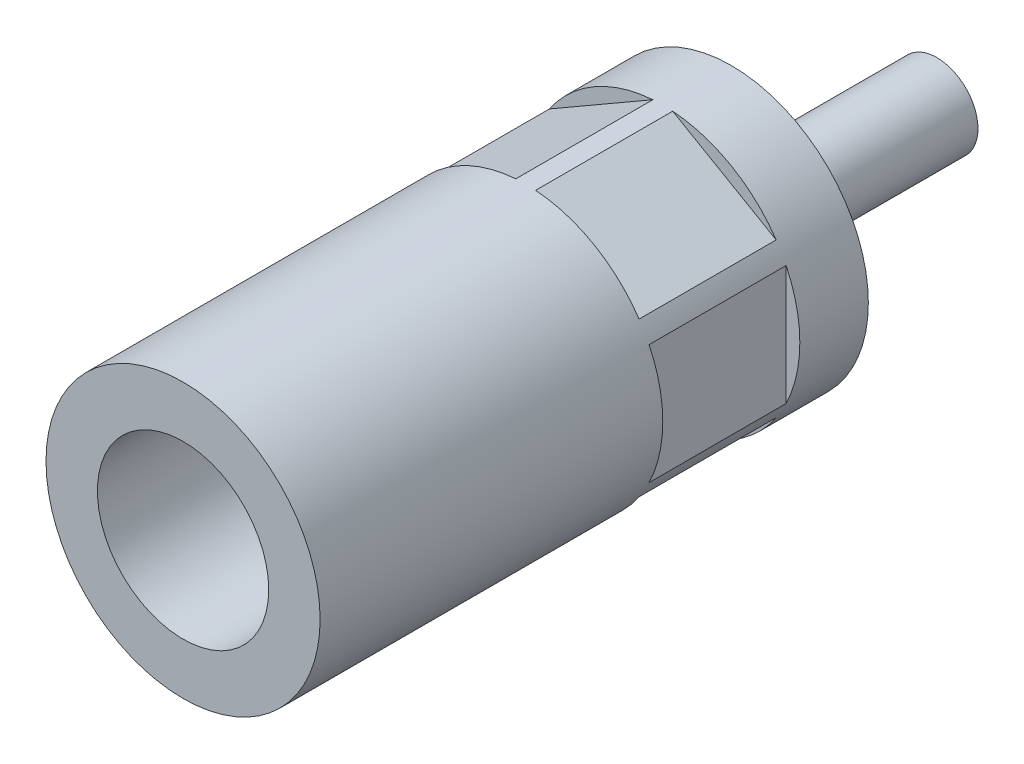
ISO-10303-21;
HEADER;
FILE_DESCRIPTION(('STEP AP214'),'2;1');
FILE_NAME('part.step','',(''),(''),'','','');
FILE_SCHEMA(('AUTOMOTIVE_DESIGN { 1 0 10303 214 1 1 1 1 }'));
ENDSEC;
DATA;
#1=APPLICATION_CONTEXT('core data for automotive mechanical design processes');
#2=APPLICATION_PROTOCOL_DEFINITION('international standard','automotive_design',2000,#1);
#3=PRODUCT_CONTEXT('',#1,'mechanical');
#4=PRODUCT('Part','Part','',(#3));
#5=PRODUCT_RELATED_PRODUCT_CATEGORY('part','',(#4));
#6=PRODUCT_DEFINITION_FORMATION('','',#4);
#7=PRODUCT_DEFINITION_CONTEXT('part definition',#1,'design');
#8=PRODUCT_DEFINITION('design','',#6,#7);
#9=PRODUCT_DEFINITION_SHAPE('','',#8);
#10=(LENGTH_UNIT() NAMED_UNIT(*) SI_UNIT(.MILLI.,.METRE.));
#11=(NAMED_UNIT(*) PLANE_ANGLE_UNIT() SI_UNIT($,.RADIAN.));
#12=(NAMED_UNIT(*) SI_UNIT($,.STERADIAN.) SOLID_ANGLE_UNIT());
#13=UNCERTAINTY_MEASURE_WITH_UNIT(LENGTH_MEASURE(1.E-05),#10,'distance_accuracy_value','');
#14=(GEOMETRIC_REPRESENTATION_CONTEXT(3) GLOBAL_UNCERTAINTY_ASSIGNED_CONTEXT((#13)) GLOBAL_UNIT_ASSIGNED_CONTEXT((#10,
#11,#12)) REPRESENTATION_CONTEXT('',''));
#15=CARTESIAN_POINT('',(0.,0.,0.));
#16=DIRECTION('',(0.,0.,1.));
#17=DIRECTION('',(1.,0.,0.));
#18=AXIS2_PLACEMENT_3D('',#15,#16,#17);
#19=CARTESIAN_POINT('',(0.,0.,80.));
#20=DIRECTION('',(0.,0.,1.));
#21=DIRECTION('',(1.,0.,0.));
#22=AXIS2_PLACEMENT_3D('',#19,#20,#21);
#23=CYLINDRICAL_SURFACE('',#22,20.);
#24=CARTESIAN_POINT('',(0.,0.,10.));
#25=DIRECTION('',(0.,0.,1.));
#26=DIRECTION('',(1.,0.,0.));
#27=AXIS2_PLACEMENT_3D('',#24,#25,#26);
#28=CIRCLE('',#27,20.);
#29=CARTESIAN_POINT('',(-16.5498344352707,-11.2295583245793,10.));
#30=VERTEX_POINT('',#29);
#31=CARTESIAN_POINT('',(-1.45016556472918,-19.9473562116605,10.));
#32=VERTEX_POINT('',#31);
#33=EDGE_CURVE('E153',#30,#32,#28,.T.);
#34=ORIENTED_EDGE('',*,*,#33,.F.);
#35=DIRECTION('',(0.,0.,1.));
#36=VECTOR('',#35,1.);
#37=CARTESIAN_POINT('',(-16.5498344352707,-11.2295583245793,80.));
#38=LINE('',#37,#36);
#39=CARTESIAN_POINT('',(-16.5498344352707,-11.2295583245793,30.));
#40=VERTEX_POINT('',#39);
#41=EDGE_CURVE('E9',#30,#40,#38,.T.);
#42=ORIENTED_EDGE('',*,*,#41,.T.);
#43=CARTESIAN_POINT('',(0.,0.,30.));
#44=DIRECTION('',(0.,0.,1.));
#45=DIRECTION('',(1.,0.,0.));
#46=AXIS2_PLACEMENT_3D('',#43,#44,#45);
#47=CIRCLE('',#46,20.);
#48=CARTESIAN_POINT('',(-1.45016556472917,-19.9473562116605,30.));
#49=VERTEX_POINT('',#48);
#50=EDGE_CURVE('E22',#40,#49,#47,.T.);
#51=ORIENTED_EDGE('',*,*,#50,.T.);
#52=DIRECTION('',(0.,0.,1.));
#53=VECTOR('',#52,1.);
#54=CARTESIAN_POINT('',(-1.45016556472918,-19.9473562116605,80.));
#55=LINE('',#54,#53);
#56=EDGE_CURVE('E150',#49,#32,#55,.F.);
#57=ORIENTED_EDGE('',*,*,#56,.T.);
#58=EDGE_LOOP('',(#34,#42,#51,#57));
#59=FACE_BOUND('',#58,.T.);
#60=DIRECTION('',(0.,0.,1.));
#61=VECTOR('',#60,1.);
#62=CARTESIAN_POINT('',(18.,8.71779788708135,80.));
#63=LINE('',#62,#61);
#64=CARTESIAN_POINT('',(18.,8.71779788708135,10.));
#65=VERTEX_POINT('',#64);
#66=CARTESIAN_POINT('',(18.,8.71779788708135,30.));
#67=VERTEX_POINT('',#66);
#68=EDGE_CURVE('E143',#65,#67,#63,.T.);
#69=ORIENTED_EDGE('',*,*,#68,.F.);
#70=CARTESIAN_POINT('',(18.,-8.71779788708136,10.));
#71=VERTEX_POINT('',#70);
#72=EDGE_CURVE('E142',#71,#65,#28,.T.);
#73=ORIENTED_EDGE('',*,*,#72,.F.);
#74=DIRECTION('',(0.,0.,1.));
#75=VECTOR('',#74,1.);
#76=CARTESIAN_POINT('',(18.,-8.71779788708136,80.));
#77=LINE('',#76,#75);
#78=CARTESIAN_POINT('',(18.,-8.71779788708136,30.));
#79=VERTEX_POINT('',#78);
#80=EDGE_CURVE('E139',#79,#71,#77,.F.);
#81=ORIENTED_EDGE('',*,*,#80,.F.);
#82=EDGE_CURVE('E146',#79,#67,#47,.T.);
#83=ORIENTED_EDGE('',*,*,#82,.T.);
#84=EDGE_LOOP('',(#69,#73,#81,#83));
#85=FACE_BOUND('',#84,.T.);
#86=CARTESIAN_POINT('',(16.5498344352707,11.2295583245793,10.));
#87=VERTEX_POINT('',#86);
#88=CARTESIAN_POINT('',(1.45016556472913,19.9473562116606,10.));
#89=VERTEX_POINT('',#88);
#90=EDGE_CURVE('E135',#87,#89,#28,.T.);
#91=ORIENTED_EDGE('',*,*,#90,.F.);
#92=DIRECTION('',(0.,0.,1.));
#93=VECTOR('',#92,1.);
#94=CARTESIAN_POINT('',(16.5498344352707,11.2295583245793,80.));
#95=LINE('',#94,#93);
#96=CARTESIAN_POINT('',(16.5498344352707,11.2295583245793,30.));
#97=VERTEX_POINT('',#96);
#98=EDGE_CURVE('E136',#87,#97,#95,.T.);
#99=ORIENTED_EDGE('',*,*,#98,.T.);
#100=CARTESIAN_POINT('',(1.45016556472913,19.9473562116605,30.));
#101=VERTEX_POINT('',#100);
#102=EDGE_CURVE('E140',#97,#101,#47,.T.);
#103=ORIENTED_EDGE('',*,*,#102,.T.);
#104=DIRECTION('',(0.,0.,1.));
#105=VECTOR('',#104,1.);
#106=CARTESIAN_POINT('',(1.45016556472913,19.9473562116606,80.));
#107=LINE('',#106,#105);
#108=EDGE_CURVE('E132',#101,#89,#107,.F.);
#109=ORIENTED_EDGE('',*,*,#108,.T.);
#110=EDGE_LOOP('',(#91,#99,#103,#109));
#111=FACE_BOUND('',#110,.T.);
#112=CARTESIAN_POINT('',(0.,0.,0.));
#113=DIRECTION('',(0.,0.,1.));
#114=DIRECTION('',(1.,0.,0.));
#115=AXIS2_PLACEMENT_3D('',#112,#113,#114);
#116=CIRCLE('',#115,20.);
#117=CARTESIAN_POINT('',(20.,0.,0.));
#118=VERTEX_POINT('',#117);
#119=EDGE_CURVE('E202',#118,#118,#116,.T.);
#120=ORIENTED_EDGE('',*,*,#119,.T.);
#121=EDGE_LOOP('',(#120));
#122=FACE_BOUND('',#121,.T.);
#123=CARTESIAN_POINT('',(0.,0.,80.));
#124=DIRECTION('',(0.,0.,1.));
#125=DIRECTION('',(1.,0.,0.));
#126=AXIS2_PLACEMENT_3D('',#123,#124,#125);
#127=CIRCLE('',#126,20.);
#128=CARTESIAN_POINT('',(20.,0.,80.));
#129=VERTEX_POINT('',#128);
#130=EDGE_CURVE('E205',#129,#129,#127,.T.);
#131=ORIENTED_EDGE('',*,*,#130,.F.);
#132=EDGE_LOOP('',(#131));
#133=FACE_BOUND('',#132,.T.);
#134=CARTESIAN_POINT('',(-18.,8.71779788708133,10.));
#135=VERTEX_POINT('',#134);
#136=CARTESIAN_POINT('',(-18.,-8.71779788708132,10.));
#137=VERTEX_POINT('',#136);
#138=EDGE_CURVE('E111',#135,#137,#28,.T.);
#139=ORIENTED_EDGE('',*,*,#138,.F.);
#140=DIRECTION('',(0.,0.,1.));
#141=VECTOR('',#140,1.);
#142=CARTESIAN_POINT('',(-18.,8.71779788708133,80.));
#143=LINE('',#142,#141);
#144=CARTESIAN_POINT('',(-18.,8.71779788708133,30.));
#145=VERTEX_POINT('',#144);
#146=EDGE_CURVE('E110',#135,#145,#143,.T.);
#147=ORIENTED_EDGE('',*,*,#146,.T.);
#148=CARTESIAN_POINT('',(-18.,-8.71779788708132,30.));
#149=VERTEX_POINT('',#148);
#150=EDGE_CURVE('E103',#145,#149,#47,.T.);
#151=ORIENTED_EDGE('',*,*,#150,.T.);
#152=DIRECTION('',(0.,0.,1.));
#153=VECTOR('',#152,1.);
#154=CARTESIAN_POINT('',(-18.,-8.71779788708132,80.));
#155=LINE('',#154,#153);
#156=EDGE_CURVE('E117',#149,#137,#155,.F.);
#157=ORIENTED_EDGE('',*,*,#156,.T.);
#158=EDGE_LOOP('',(#139,#147,#151,#157));
#159=FACE_BOUND('',#158,.T.);
#160=DIRECTION('',(0.,0.,1.));
#161=VECTOR('',#160,1.);
#162=CARTESIAN_POINT('',(-16.5498344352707,11.2295583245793,80.));
#163=LINE('',#162,#161);
#164=CARTESIAN_POINT('',(-16.5498344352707,11.2295583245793,10.));
#165=VERTEX_POINT('',#164);
#166=CARTESIAN_POINT('',(-16.5498344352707,11.2295583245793,30.));
#167=VERTEX_POINT('',#166);
#168=EDGE_CURVE('E130',#165,#167,#163,.T.);
#169=ORIENTED_EDGE('',*,*,#168,.F.);
#170=CARTESIAN_POINT('',(-1.45016556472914,19.9473562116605,10.));
#171=VERTEX_POINT('',#170);
#172=EDGE_CURVE('E126',#171,#165,#28,.T.);
#173=ORIENTED_EDGE('',*,*,#172,.F.);
#174=DIRECTION('',(0.,0.,1.));
#175=VECTOR('',#174,1.);
#176=CARTESIAN_POINT('',(-1.45016556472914,19.9473562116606,80.));
#177=LINE('',#176,#175);
#178=CARTESIAN_POINT('',(-1.45016556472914,19.9473562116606,30.));
#179=VERTEX_POINT('',#178);
#180=EDGE_CURVE('E124',#179,#171,#177,.F.);
#181=ORIENTED_EDGE('',*,*,#180,.F.);
#182=EDGE_CURVE('E113',#179,#167,#47,.T.);
#183=ORIENTED_EDGE('',*,*,#182,.T.);
#184=EDGE_LOOP('',(#169,#173,#181,#183));
#185=FACE_BOUND('',#184,.T.);
#186=DIRECTION('',(0.,0.,1.));
#187=VECTOR('',#186,1.);
#188=CARTESIAN_POINT('',(16.5498344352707,-11.2295583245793,80.));
#189=LINE('',#188,#187);
#190=CARTESIAN_POINT('',(16.5498344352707,-11.2295583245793,10.));
#191=VERTEX_POINT('',#190);
#192=CARTESIAN_POINT('',(16.5498344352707,-11.2295583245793,30.));
#193=VERTEX_POINT('',#192);
#194=EDGE_CURVE('E149',#191,#193,#189,.T.);
#195=ORIENTED_EDGE('',*,*,#194,.F.);
#196=CARTESIAN_POINT('',(1.45016556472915,-19.9473562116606,10.));
#197=VERTEX_POINT('',#196);
#198=EDGE_CURVE('E148',#197,#191,#28,.T.);
#199=ORIENTED_EDGE('',*,*,#198,.F.);
#200=DIRECTION('',(0.,0.,1.));
#201=VECTOR('',#200,1.);
#202=CARTESIAN_POINT('',(1.45016556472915,-19.9473562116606,80.));
#203=LINE('',#202,#201);
#204=CARTESIAN_POINT('',(1.45016556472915,-19.9473562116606,30.));
#205=VERTEX_POINT('',#204);
#206=EDGE_CURVE('E145',#205,#197,#203,.F.);
#207=ORIENTED_EDGE('',*,*,#206,.F.);
#208=EDGE_CURVE('E151',#205,#193,#47,.T.);
#209=ORIENTED_EDGE('',*,*,#208,.T.);
#210=EDGE_LOOP('',(#195,#199,#207,#209));
#211=FACE_BOUND('',#210,.T.);
#212=ADVANCED_FACE('F14',(#59,#85,#111,#122,#133,#159,#185,#211),#23,.T.);
#213=CARTESIAN_POINT('',(0.,0.,-30.));
#214=DIRECTION('',(0.,0.,1.));
#215=DIRECTION('',(1.,0.,0.));
#216=AXIS2_PLACEMENT_3D('',#213,#214,#215);
#217=PLANE('',#216);
#218=CARTESIAN_POINT('',(0.,0.,-30.));
#219=DIRECTION('',(0.,0.,1.));
#220=DIRECTION('',(1.,0.,0.));
#221=AXIS2_PLACEMENT_3D('',#218,#219,#220);
#222=CIRCLE('',#221,6.);
#223=CARTESIAN_POINT('',(6.,0.,-30.));
#224=VERTEX_POINT('',#223);
#225=EDGE_CURVE('E118',#224,#224,#222,.T.);
#226=ORIENTED_EDGE('',*,*,#225,.F.);
#227=EDGE_LOOP('',(#226));
#228=FACE_BOUND('',#227,.T.);
#229=ADVANCED_FACE('F16',(#228),#217,.F.);
#230=CARTESIAN_POINT('',(6.,0.,9.));
#231=DIRECTION('',(0.,0.,-1.));
#232=DIRECTION('',(-1.,0.,0.));
#233=AXIS2_PLACEMENT_3D('',#230,#231,#232);
#234=PLANE('',#233);
#235=CARTESIAN_POINT('',(0.,0.,9.));
#236=DIRECTION('',(0.,0.,1.));
#237=DIRECTION('',(1.,0.,0.));
#238=AXIS2_PLACEMENT_3D('',#235,#236,#237);
#239=CIRCLE('',#238,6.);
#240=CARTESIAN_POINT('',(6.,0.,9.));
#241=VERTEX_POINT('',#240);
#242=EDGE_CURVE('E160',#241,#241,#239,.T.);
#243=ORIENTED_EDGE('',*,*,#242,.T.);
#244=EDGE_LOOP('',(#243));
#245=FACE_BOUND('',#244,.T.);
#246=ADVANCED_FACE('F220',(#245),#234,.F.);
#247=CARTESIAN_POINT('',(0.,0.,80.));
#248=DIRECTION('',(0.,0.,1.));
#249=DIRECTION('',(1.,0.,0.));
#250=AXIS2_PLACEMENT_3D('',#247,#248,#249);
#251=CYLINDRICAL_SURFACE('',#250,6.);
#252=ORIENTED_EDGE('',*,*,#242,.F.);
#253=EDGE_LOOP('',(#252));
#254=FACE_BOUND('',#253,.T.);
#255=CARTESIAN_POINT('',(0.,0.,40.));
#256=DIRECTION('',(0.,0.,1.));
#257=DIRECTION('',(1.,0.,0.));
#258=AXIS2_PLACEMENT_3D('',#255,#256,#257);
#259=CIRCLE('',#258,6.);
#260=CARTESIAN_POINT('',(6.,0.,40.));
#261=VERTEX_POINT('',#260);
#262=EDGE_CURVE('E214',#261,#261,#259,.T.);
#263=ORIENTED_EDGE('',*,*,#262,.T.);
#264=EDGE_LOOP('',(#263));
#265=FACE_BOUND('',#264,.T.);
#266=ADVANCED_FACE('F222',(#254,#265),#251,.F.);
#267=CARTESIAN_POINT('',(6.,0.,40.));
#268=DIRECTION('',(0.,0.,1.));
#269=DIRECTION('',(1.,0.,0.));
#270=AXIS2_PLACEMENT_3D('',#267,#268,#269);
#271=PLANE('',#270);
#272=CARTESIAN_POINT('',(0.,0.,40.));
#273=DIRECTION('',(0.,0.,1.));
#274=DIRECTION('',(1.,0.,0.));
#275=AXIS2_PLACEMENT_3D('',#272,#273,#274);
#276=CIRCLE('',#275,12.5);
#277=CARTESIAN_POINT('',(12.5,0.,40.));
#278=VERTEX_POINT('',#277);
#279=EDGE_CURVE('E211',#278,#278,#276,.T.);
#280=ORIENTED_EDGE('',*,*,#279,.T.);
#281=EDGE_LOOP('',(#280));
#282=FACE_BOUND('',#281,.T.);
#283=ORIENTED_EDGE('',*,*,#262,.F.);
#284=EDGE_LOOP('',(#283));
#285=FACE_BOUND('',#284,.T.);
#286=ADVANCED_FACE('F225',(#282,#285),#271,.T.);
#287=CARTESIAN_POINT('',(0.,0.,80.));
#288=DIRECTION('',(0.,0.,1.));
#289=DIRECTION('',(1.,0.,0.));
#290=AXIS2_PLACEMENT_3D('',#287,#288,#289);
#291=CYLINDRICAL_SURFACE('',#290,12.5);
#292=ORIENTED_EDGE('',*,*,#279,.F.);
#293=EDGE_LOOP('',(#292));
#294=FACE_BOUND('',#293,.T.);
#295=CARTESIAN_POINT('',(0.,0.,80.));
#296=DIRECTION('',(0.,0.,1.));
#297=DIRECTION('',(1.,0.,0.));
#298=AXIS2_PLACEMENT_3D('',#295,#296,#297);
#299=CIRCLE('',#298,12.5);
#300=CARTESIAN_POINT('',(12.5,0.,80.));
#301=VERTEX_POINT('',#300);
#302=EDGE_CURVE('E208',#301,#301,#299,.T.);
#303=ORIENTED_EDGE('',*,*,#302,.T.);
#304=EDGE_LOOP('',(#303));
#305=FACE_BOUND('',#304,.T.);
#306=ADVANCED_FACE('F230',(#294,#305),#291,.F.);
#307=CARTESIAN_POINT('',(20.,0.,80.));
#308=DIRECTION('',(0.,0.,-1.));
#309=DIRECTION('',(-1.,0.,0.));
#310=AXIS2_PLACEMENT_3D('',#307,#308,#309);
#311=PLANE('',#310);
#312=ORIENTED_EDGE('',*,*,#302,.F.);
#313=EDGE_LOOP('',(#312));
#314=FACE_BOUND('',#313,.T.);
#315=ORIENTED_EDGE('',*,*,#130,.T.);
#316=EDGE_LOOP('',(#315));
#317=FACE_BOUND('',#316,.T.);
#318=ADVANCED_FACE('F238',(#314,#317),#311,.F.);
#319=CARTESIAN_POINT('',(20.,0.,0.));
#320=DIRECTION('',(0.,0.,-1.));
#321=DIRECTION('',(-1.,0.,0.));
#322=AXIS2_PLACEMENT_3D('',#319,#320,#321);
#323=PLANE('',#322);
#324=CARTESIAN_POINT('',(0.,0.,0.));
#325=DIRECTION('',(0.,0.,1.));
#326=DIRECTION('',(1.,0.,0.));
#327=AXIS2_PLACEMENT_3D('',#324,#325,#326);
#328=CIRCLE('',#327,6.);
#329=CARTESIAN_POINT('',(6.,0.,0.));
#330=VERTEX_POINT('',#329);
#331=EDGE_CURVE('E199',#330,#330,#328,.T.);
#332=ORIENTED_EDGE('',*,*,#331,.T.);
#333=EDGE_LOOP('',(#332));
#334=FACE_BOUND('',#333,.T.);
#335=ORIENTED_EDGE('',*,*,#119,.F.);
#336=EDGE_LOOP('',(#335));
#337=FACE_BOUND('',#336,.T.);
#338=ADVANCED_FACE('F250',(#334,#337),#323,.T.);
#339=CARTESIAN_POINT('',(0.,0.,80.));
#340=DIRECTION('',(0.,0.,1.));
#341=DIRECTION('',(1.,0.,0.));
#342=AXIS2_PLACEMENT_3D('',#339,#340,#341);
#343=CYLINDRICAL_SURFACE('',#342,6.);
#344=ORIENTED_EDGE('',*,*,#331,.F.);
#345=EDGE_LOOP('',(#344));
#346=FACE_BOUND('',#345,.T.);
#347=ORIENTED_EDGE('',*,*,#225,.T.);
#348=EDGE_LOOP('',(#347));
#349=FACE_BOUND('',#348,.T.);
#350=ADVANCED_FACE('F258',(#346,#349),#343,.T.);
#351=CARTESIAN_POINT('',(-18.,10.3923048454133,30.));
#352=DIRECTION('',(1.,0.,0.));
#353=DIRECTION('',(0.,1.,0.));
#354=AXIS2_PLACEMENT_3D('',#351,#352,#353);
#355=PLANE('',#354);
#356=DIRECTION('',(0.,-1.,0.));
#357=VECTOR('',#356,1.);
#358=CARTESIAN_POINT('',(-18.,10.3923048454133,10.));
#359=LINE('',#358,#357);
#360=EDGE_CURVE('E193',#135,#137,#359,.T.);
#361=ORIENTED_EDGE('',*,*,#360,.T.);
#362=ORIENTED_EDGE('',*,*,#156,.F.);
#363=DIRECTION('',(0.,-1.,0.));
#364=VECTOR('',#363,1.);
#365=CARTESIAN_POINT('',(-18.,10.3923048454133,30.));
#366=LINE('',#365,#364);
#367=EDGE_CURVE('E106',#145,#149,#366,.T.);
#368=ORIENTED_EDGE('',*,*,#367,.F.);
#369=ORIENTED_EDGE('',*,*,#146,.F.);
#370=EDGE_LOOP('',(#361,#362,#368,#369));
#371=FACE_BOUND('',#370,.T.);
#372=ADVANCED_FACE('F115',(#371),#355,.F.);
#373=CARTESIAN_POINT('',(0.,0.,10.));
#374=DIRECTION('',(0.,0.,1.));
#375=DIRECTION('',(1.,0.,0.));
#376=AXIS2_PLACEMENT_3D('',#373,#374,#375);
#377=PLANE('',#376);
#378=ORIENTED_EDGE('',*,*,#138,.T.);
#379=ORIENTED_EDGE('',*,*,#360,.F.);
#380=EDGE_LOOP('',(#378,#379));
#381=FACE_BOUND('',#380,.T.);
#382=ADVANCED_FACE('F280',(#381),#377,.T.);
#383=CARTESIAN_POINT('',(0.,0.,30.));
#384=DIRECTION('',(0.,0.,1.));
#385=DIRECTION('',(1.,0.,0.));
#386=AXIS2_PLACEMENT_3D('',#383,#384,#385);
#387=PLANE('',#386);
#388=ORIENTED_EDGE('',*,*,#367,.T.);
#389=ORIENTED_EDGE('',*,*,#150,.F.);
#390=EDGE_LOOP('',(#388,#389));
#391=FACE_BOUND('',#390,.T.);
#392=ADVANCED_FACE('F105',(#391),#387,.F.);
#393=CARTESIAN_POINT('',(-18.,10.3923048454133,30.));
#394=DIRECTION('',(-0.5,0.866025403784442,0.));
#395=DIRECTION('',(-0.866025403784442,-0.5,0.));
#396=AXIS2_PLACEMENT_3D('',#393,#394,#395);
#397=PLANE('',#396);
#398=ORIENTED_EDGE('',*,*,#168,.T.);
#399=DIRECTION('',(0.866025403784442,0.5,0.));
#400=VECTOR('',#399,1.);
#401=CARTESIAN_POINT('',(-18.,10.3923048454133,30.));
#402=LINE('',#401,#400);
#403=EDGE_CURVE('E119',#167,#179,#402,.T.);
#404=ORIENTED_EDGE('',*,*,#403,.T.);
#405=ORIENTED_EDGE('',*,*,#180,.T.);
#406=DIRECTION('',(0.866025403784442,0.5,0.));
#407=VECTOR('',#406,1.);
#408=CARTESIAN_POINT('',(-18.,10.3923048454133,10.));
#409=LINE('',#408,#407);
#410=EDGE_CURVE('E344',#165,#171,#409,.T.);
#411=ORIENTED_EDGE('',*,*,#410,.F.);
#412=EDGE_LOOP('',(#398,#404,#405,#411));
#413=FACE_BOUND('',#412,.T.);
#414=ADVANCED_FACE('F306',(#413),#397,.T.);
#415=ORIENTED_EDGE('',*,*,#172,.T.);
#416=ORIENTED_EDGE('',*,*,#410,.T.);
#417=EDGE_LOOP('',(#415,#416));
#418=FACE_BOUND('',#417,.T.);
#419=ADVANCED_FACE('F294',(#418),#377,.T.);
#420=ORIENTED_EDGE('',*,*,#403,.F.);
#421=ORIENTED_EDGE('',*,*,#182,.F.);
#422=EDGE_LOOP('',(#420,#421));
#423=FACE_BOUND('',#422,.T.);
#424=ADVANCED_FACE('F289',(#423),#387,.F.);
#425=CARTESIAN_POINT('',(18.,10.3923048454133,30.));
#426=DIRECTION('',(-0.499999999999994,-0.866025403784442,0.));
#427=DIRECTION('',(0.866025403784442,-0.499999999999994,0.));
#428=AXIS2_PLACEMENT_3D('',#425,#426,#427);
#429=PLANE('',#428);
#430=DIRECTION('',(-0.866025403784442,0.499999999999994,0.));
#431=VECTOR('',#430,1.);
#432=CARTESIAN_POINT('',(18.,10.3923048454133,10.));
#433=LINE('',#432,#431);
#434=EDGE_CURVE('E345',#87,#89,#433,.T.);
#435=ORIENTED_EDGE('',*,*,#434,.T.);
#436=ORIENTED_EDGE('',*,*,#108,.F.);
#437=DIRECTION('',(-0.866025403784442,0.499999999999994,0.));
#438=VECTOR('',#437,1.);
#439=CARTESIAN_POINT('',(18.,10.3923048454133,30.));
#440=LINE('',#439,#438);
#441=EDGE_CURVE('E190',#97,#101,#440,.T.);
#442=ORIENTED_EDGE('',*,*,#441,.F.);
#443=ORIENTED_EDGE('',*,*,#98,.F.);
#444=EDGE_LOOP('',(#435,#436,#442,#443));
#445=FACE_BOUND('',#444,.T.);
#446=ADVANCED_FACE('F293',(#445),#429,.F.);
#447=ORIENTED_EDGE('',*,*,#90,.T.);
#448=ORIENTED_EDGE('',*,*,#434,.F.);
#449=EDGE_LOOP('',(#447,#448));
#450=FACE_BOUND('',#449,.T.);
#451=ADVANCED_FACE('F287',(#450),#377,.T.);
#452=ORIENTED_EDGE('',*,*,#441,.T.);
#453=ORIENTED_EDGE('',*,*,#102,.F.);
#454=EDGE_LOOP('',(#452,#453));
#455=FACE_BOUND('',#454,.T.);
#456=ADVANCED_FACE('F283',(#455),#387,.F.);
#457=CARTESIAN_POINT('',(18.,10.3923048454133,30.));
#458=DIRECTION('',(1.,0.,0.));
#459=DIRECTION('',(0.,1.,0.));
#460=AXIS2_PLACEMENT_3D('',#457,#458,#459);
#461=PLANE('',#460);
#462=ORIENTED_EDGE('',*,*,#68,.T.);
#463=DIRECTION('',(0.,-1.,0.));
#464=VECTOR('',#463,1.);
#465=CARTESIAN_POINT('',(18.,10.3923048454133,30.));
#466=LINE('',#465,#464);
#467=EDGE_CURVE('E187',#67,#79,#466,.T.);
#468=ORIENTED_EDGE('',*,*,#467,.T.);
#469=ORIENTED_EDGE('',*,*,#80,.T.);
#470=DIRECTION('',(0.,-1.,0.));
#471=VECTOR('',#470,1.);
#472=CARTESIAN_POINT('',(18.,10.3923048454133,10.));
#473=LINE('',#472,#471);
#474=EDGE_CURVE('E348',#65,#71,#473,.T.);
#475=ORIENTED_EDGE('',*,*,#474,.F.);
#476=EDGE_LOOP('',(#462,#468,#469,#475));
#477=FACE_BOUND('',#476,.T.);
#478=ADVANCED_FACE('F286',(#477),#461,.T.);
#479=ORIENTED_EDGE('',*,*,#72,.T.);
#480=ORIENTED_EDGE('',*,*,#474,.T.);
#481=EDGE_LOOP('',(#479,#480));
#482=FACE_BOUND('',#481,.T.);
#483=ADVANCED_FACE('F295',(#482),#377,.T.);
#484=ORIENTED_EDGE('',*,*,#467,.F.);
#485=ORIENTED_EDGE('',*,*,#82,.F.);
#486=EDGE_LOOP('',(#484,#485));
#487=FACE_BOUND('',#486,.T.);
#488=ADVANCED_FACE('F290',(#487),#387,.F.);
#489=CARTESIAN_POINT('',(18.,-10.3923048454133,30.));
#490=DIRECTION('',(0.5,-0.866025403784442,0.));
#491=DIRECTION('',(0.866025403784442,0.5,0.));
#492=AXIS2_PLACEMENT_3D('',#489,#490,#491);
#493=PLANE('',#492);
#494=ORIENTED_EDGE('',*,*,#194,.T.);
#495=DIRECTION('',(-0.866025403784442,-0.5,0.));
#496=VECTOR('',#495,1.);
#497=CARTESIAN_POINT('',(18.,-10.3923048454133,30.));
#498=LINE('',#497,#496);
#499=EDGE_CURVE('E37',#193,#205,#498,.T.);
#500=ORIENTED_EDGE('',*,*,#499,.T.);
#501=ORIENTED_EDGE('',*,*,#206,.T.);
#502=DIRECTION('',(-0.866025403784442,-0.5,0.));
#503=VECTOR('',#502,1.);
#504=CARTESIAN_POINT('',(18.,-10.3923048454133,10.));
#505=LINE('',#504,#503);
#506=EDGE_CURVE('E352',#191,#197,#505,.T.);
#507=ORIENTED_EDGE('',*,*,#506,.F.);
#508=EDGE_LOOP('',(#494,#500,#501,#507));
#509=FACE_BOUND('',#508,.T.);
#510=ADVANCED_FACE('F296',(#509),#493,.T.);
#511=ORIENTED_EDGE('',*,*,#198,.T.);
#512=ORIENTED_EDGE('',*,*,#506,.T.);
#513=EDGE_LOOP('',(#511,#512));
#514=FACE_BOUND('',#513,.T.);
#515=ADVANCED_FACE('F299',(#514),#377,.T.);
#516=ORIENTED_EDGE('',*,*,#499,.F.);
#517=ORIENTED_EDGE('',*,*,#208,.F.);
#518=EDGE_LOOP('',(#516,#517));
#519=FACE_BOUND('',#518,.T.);
#520=ADVANCED_FACE('F186',(#519),#387,.F.);
#521=DIRECTION('',(0.866025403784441,-0.5,0.));
#522=VECTOR('',#521,1.);
#523=CARTESIAN_POINT('',(-18.,-10.3923048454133,30.));
#524=LINE('',#523,#522);
#525=EDGE_CURVE('E188',#40,#49,#524,.T.);
#526=ORIENTED_EDGE('',*,*,#525,.T.);
#527=ORIENTED_EDGE('',*,*,#50,.F.);
#528=EDGE_LOOP('',(#526,#527));
#529=FACE_BOUND('',#528,.T.);
#530=ADVANCED_FACE('F317',(#529),#387,.F.);
#531=ORIENTED_EDGE('',*,*,#33,.T.);
#532=DIRECTION('',(0.866025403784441,-0.5,0.));
#533=VECTOR('',#532,1.);
#534=CARTESIAN_POINT('',(-18.,-10.3923048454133,10.));
#535=LINE('',#534,#533);
#536=EDGE_CURVE('E29',#30,#32,#535,.T.);
#537=ORIENTED_EDGE('',*,*,#536,.F.);
#538=EDGE_LOOP('',(#531,#537));
#539=FACE_BOUND('',#538,.T.);
#540=ADVANCED_FACE('F312',(#539),#377,.T.);
#541=CARTESIAN_POINT('',(-18.,-10.3923048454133,30.));
#542=DIRECTION('',(0.5,0.866025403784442,0.));
#543=DIRECTION('',(-0.866025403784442,0.5,0.));
#544=AXIS2_PLACEMENT_3D('',#541,#542,#543);
#545=PLANE('',#544);
#546=ORIENTED_EDGE('',*,*,#536,.T.);
#547=ORIENTED_EDGE('',*,*,#56,.F.);
#548=ORIENTED_EDGE('',*,*,#525,.F.);
#549=ORIENTED_EDGE('',*,*,#41,.F.);
#550=EDGE_LOOP('',(#546,#547,#548,#549));
#551=FACE_BOUND('',#550,.T.);
#552=ADVANCED_FACE('F310',(#551),#545,.F.);
#553=CLOSED_SHELL('',(#212,#229,#246,#266,#286,#306,#318,#338,#350,#372,#382,#392,#414,#419,
#424,#446,#451,#456,#478,#483,#488,#510,#515,#520,#530,#540,#552));
#554=MANIFOLD_SOLID_BREP('B1',#553);
#555=ADVANCED_BREP_SHAPE_REPRESENTATION('',(#18,#554),#14);
#556=SHAPE_DEFINITION_REPRESENTATION(#9,#555);
ENDSEC;
END-ISO-10303-21;
